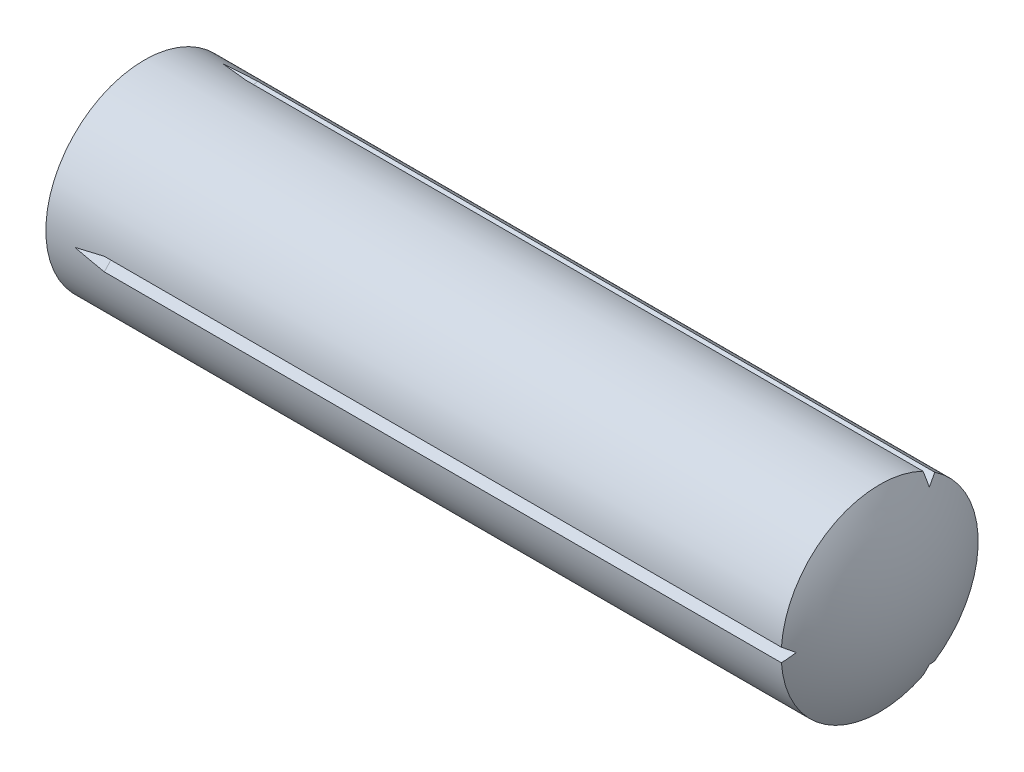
ISO-10303-21;
HEADER;
FILE_DESCRIPTION(('STEP AP214'),'2;1');
FILE_NAME('part.step','',(''),(''),'','','');
FILE_SCHEMA(('AUTOMOTIVE_DESIGN { 1 0 10303 214 1 1 1 1 }'));
ENDSEC;
DATA;
#1=APPLICATION_CONTEXT('core data for automotive mechanical design processes');
#2=APPLICATION_PROTOCOL_DEFINITION('international standard','automotive_design',2000,#1);
#3=PRODUCT_CONTEXT('',#1,'mechanical');
#4=PRODUCT('Part','Part','',(#3));
#5=PRODUCT_RELATED_PRODUCT_CATEGORY('part','',(#4));
#6=PRODUCT_DEFINITION_FORMATION('','',#4);
#7=PRODUCT_DEFINITION_CONTEXT('part definition',#1,'design');
#8=PRODUCT_DEFINITION('design','',#6,#7);
#9=PRODUCT_DEFINITION_SHAPE('','',#8);
#10=(LENGTH_UNIT() NAMED_UNIT(*) SI_UNIT(.MILLI.,.METRE.));
#11=(NAMED_UNIT(*) PLANE_ANGLE_UNIT() SI_UNIT($,.RADIAN.));
#12=(NAMED_UNIT(*) SI_UNIT($,.STERADIAN.) SOLID_ANGLE_UNIT());
#13=UNCERTAINTY_MEASURE_WITH_UNIT(LENGTH_MEASURE(1.E-05),#10,'distance_accuracy_value','');
#14=(GEOMETRIC_REPRESENTATION_CONTEXT(3) GLOBAL_UNCERTAINTY_ASSIGNED_CONTEXT((#13)) GLOBAL_UNIT_ASSIGNED_CONTEXT((#10,
#11,#12)) REPRESENTATION_CONTEXT('',''));
#15=CARTESIAN_POINT('',(0.,0.,0.));
#16=DIRECTION('',(0.,0.,1.));
#17=DIRECTION('',(1.,0.,0.));
#18=AXIS2_PLACEMENT_3D('',#15,#16,#17);
#19=CARTESIAN_POINT('',(-75.0312695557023,0.,0.));
#20=DIRECTION('',(-1.,0.,0.));
#21=DIRECTION('',(0.,1.,0.));
#22=AXIS2_PLACEMENT_3D('',#19,#20,#21);
#23=SPHERICAL_SURFACE('',#22,25.);
#24=CARTESIAN_POINT('',(-100.,0.,0.));
#25=DIRECTION('',(-1.,0.,0.));
#26=DIRECTION('',(0.,0.,1.));
#27=AXIS2_PLACEMENT_3D('',#24,#25,#26);
#28=CIRCLE('',#27,1.25);
#29=CARTESIAN_POINT('',(-100.,1.2500000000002,0.));
#30=VERTEX_POINT('',#29);
#31=EDGE_CURVE('E189',#30,#30,#28,.T.);
#32=CARTESIAN_POINT('',(-96.6819046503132,0.,0.));
#33=DIRECTION('',(-1.,0.,0.));
#34=DIRECTION('',(0.,0.,1.));
#35=AXIS2_PLACEMENT_3D('',#32,#33,#34);
#36=CIRCLE('',#35,12.5);
#37=CARTESIAN_POINT('',(-96.6819046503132,12.5,0.));
#38=VERTEX_POINT('',#37);
#39=EDGE_CURVE('E181',#38,#38,#36,.T.);
#40=CARTESIAN_POINT('',(-100.,1.2500000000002,0.));
#41=CARTESIAN_POINT('',(-99.9938336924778,1.37317333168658,0.));
#42=CARTESIAN_POINT('',(-99.9867558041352,1.49630102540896,0.));
#43=CARTESIAN_POINT('',(-99.9707787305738,1.74243819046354,0.));
#44=CARTESIAN_POINT('',(-99.9618795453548,1.86544766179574,0.));
#45=CARTESIAN_POINT('',(-99.942261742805,2.11132143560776,0.));
#46=CARTESIAN_POINT('',(-99.931543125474,2.23418573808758,0.));
#47=CARTESIAN_POINT('',(-99.9082888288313,2.47974226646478,0.));
#48=CARTESIAN_POINT('',(-99.8957531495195,2.60243449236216,0.));
#49=CARTESIAN_POINT('',(-99.8688674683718,2.84761999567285,0.));
#50=CARTESIAN_POINT('',(-99.854517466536,2.97011327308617,0.));
#51=CARTESIAN_POINT('',(-99.8240062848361,3.21487405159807,0.));
#52=CARTESIAN_POINT('',(-99.8078451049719,3.33714155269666,0.));
#53=CARTESIAN_POINT('',(-99.7737151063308,3.58142400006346,0.));
#54=CARTESIAN_POINT('',(-99.7557462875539,3.70343894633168,0.));
#55=CARTESIAN_POINT('',(-99.718004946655,3.94718956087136,0.));
#56=CARTESIAN_POINT('',(-99.698232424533,4.06892522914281,0.));
#57=CARTESIAN_POINT('',(-99.6568880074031,4.31209062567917,0.));
#58=CARTESIAN_POINT('',(-99.6353161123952,4.43352035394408,0.));
#59=CARTESIAN_POINT('',(-99.5903776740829,4.6760472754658,0.));
#60=CARTESIAN_POINT('',(-99.5670111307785,4.7971444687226,0.));
#61=CARTESIAN_POINT('',(-99.5184885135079,5.03897979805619,0.));
#62=CARTESIAN_POINT('',(-99.4933324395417,5.15971793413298,0.));
#63=CARTESIAN_POINT('',(-99.4412362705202,5.40080870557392,0.));
#64=CARTESIAN_POINT('',(-99.414296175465,5.52116134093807,0.));
#65=CARTESIAN_POINT('',(-99.3586378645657,5.76145475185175,0.));
#66=CARTESIAN_POINT('',(-99.3299196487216,5.88139552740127,0.));
#67=CARTESIAN_POINT('',(-99.2707113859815,6.12083894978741,0.));
#68=CARTESIAN_POINT('',(-99.2402213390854,6.24034159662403,0.));
#69=CARTESIAN_POINT('',(-99.1774760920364,6.47888258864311,0.));
#70=CARTESIAN_POINT('',(-99.1452208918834,6.59792093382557,0.));
#71=CARTESIAN_POINT('',(-99.078952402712,6.83550725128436,0.));
#72=CARTESIAN_POINT('',(-99.0449391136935,6.95405522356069,0.));
#73=CARTESIAN_POINT('',(-98.9751618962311,7.19063483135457,0.));
#74=CARTESIAN_POINT('',(-98.9393979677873,7.30866646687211,0.));
#75=CARTESIAN_POINT('',(-98.8661273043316,7.54418755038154,0.));
#76=CARTESIAN_POINT('',(-98.8286205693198,7.66167699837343,0.));
#77=CARTESIAN_POINT('',(-98.7518725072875,7.8960879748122,0.));
#78=CARTESIAN_POINT('',(-98.712631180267,8.01300950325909,0.));
#79=CARTESIAN_POINT('',(-98.6324225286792,8.24625903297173,0.));
#80=CARTESIAN_POINT('',(-98.5914552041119,8.36258703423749,0.));
#81=CARTESIAN_POINT('',(-98.5078035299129,8.59462403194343,0.));
#82=CARTESIAN_POINT('',(-98.4651191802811,8.71033302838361,0.));
#83=CARTESIAN_POINT('',(-98.3780428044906,8.94110667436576,0.));
#84=CARTESIAN_POINT('',(-98.3336507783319,9.05617132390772,0.));
#85=CARTESIAN_POINT('',(-98.2431687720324,9.28563107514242,0.));
#86=CARTESIAN_POINT('',(-98.1970787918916,9.40002617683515,0.));
#87=CARTESIAN_POINT('',(-98.1032109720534,9.62812177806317,0.));
#88=CARTESIAN_POINT('',(-98.055433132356,9.74182227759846,0.));
#89=CARTESIAN_POINT('',(-97.9582000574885,9.96850377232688,0.));
#90=CARTESIAN_POINT('',(-97.9087448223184,10.08148476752,0.));
#91=CARTESIAN_POINT('',(-97.8081677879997,10.3067025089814,0.));
#92=CARTESIAN_POINT('',(-97.7570459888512,10.4189392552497,0.));
#93=CARTESIAN_POINT('',(-97.6531470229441,10.6426439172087,0.));
#94=CARTESIAN_POINT('',(-97.6003698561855,10.7541118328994,0.));
#95=CARTESIAN_POINT('',(-97.4931717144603,10.9762544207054,0.));
#96=CARTESIAN_POINT('',(-97.4387507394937,11.0869290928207,0.));
#97=CARTESIAN_POINT('',(-97.3282768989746,11.307460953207,0.));
#98=CARTESIAN_POINT('',(-97.272224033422,11.417318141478,0.));
#99=CARTESIAN_POINT('',(-97.1584986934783,11.6361909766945,0.));
#100=CARTESIAN_POINT('',(-97.1008262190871,11.7452066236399,0.));
#101=CARTESIAN_POINT('',(-96.9838742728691,11.9623724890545,0.));
#102=CARTESIAN_POINT('',(-96.9245948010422,12.0705227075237,0.));
#103=CARTESIAN_POINT('',(-96.8044419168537,12.2859340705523,0.));
#104=CARTESIAN_POINT('',(-96.743568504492,12.3931952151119,0.));
#105=CARTESIAN_POINT('',(-96.6819046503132,12.5,0.));
#106=B_SPLINE_CURVE_WITH_KNOTS('',3,(#40,#41,#42,#43,#44,#45,#46,#47,#48,#49,#50,#51,#52,#53,
#54,#55,#56,#57,#58,#59,#60,#61,#62,#63,#64,#65,#66,#67,#68,#69,#70,#71,#72,#73,#74,#75,#76,#77,
#78,#79,#80,#81,#82,#83,#84,#85,#86,#87,#88,#89,#90,#91,#92,#93,#94,#95,#96,#97,#98,#99,#100,
#101,#102,#103,#104,#105),.UNSPECIFIED.,.F.,.F.,(4,2,2,2,2,2,2,2,2,2,2,2,2,2,2,2,2,2,2,2,2,2,2,
2,2,2,2,2,2,2,2,2,4),(0.,0.369979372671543,0.739958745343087,1.10993811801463,1.47991749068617,
1.84989686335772,2.21987623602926,2.5898556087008,2.95983498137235,3.32981435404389,
3.69979372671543,4.06977309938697,4.43975247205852,4.80973184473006,5.17971121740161,
5.54969059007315,5.91966996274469,6.28964933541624,6.65962870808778,7.02960808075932,
7.39958745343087,7.76956682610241,8.13954619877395,8.5095255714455,8.87950494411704,
9.24948431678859,9.61946368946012,9.98944306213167,10.3594224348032,10.7294018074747,
11.0993811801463,11.4693605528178,11.8393399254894),.UNSPECIFIED.);
#107=EDGE_CURVE('BSEAM45',#30,#38,#106,.T.);
#108=ORIENTED_EDGE('',*,*,#31,.F.);
#109=ORIENTED_EDGE('',*,*,#39,.T.);
#110=ORIENTED_EDGE('',*,*,#107,.T.);
#111=ORIENTED_EDGE('',*,*,#107,.F.);
#112=EDGE_LOOP('',(#108,#110,#109,#111));
#113=FACE_BOUND('',#112,.T.);
#114=ADVANCED_FACE('F45',(#113),#23,.T.);
#115=CARTESIAN_POINT('',(-100.,0.,0.));
#116=DIRECTION('',(1.,0.,0.));
#117=DIRECTION('',(0.,0.,-1.));
#118=AXIS2_PLACEMENT_3D('',#115,#116,#117);
#119=PLANE('',#118);
#120=ORIENTED_EDGE('',*,*,#31,.T.);
#121=EDGE_LOOP('',(#120));
#122=FACE_BOUND('',#121,.T.);
#123=ADVANCED_FACE('F247',(#122),#119,.F.);
#124=CARTESIAN_POINT('',(-25.,0.,0.));
#125=DIRECTION('',(-1.,0.,0.));
#126=DIRECTION('',(0.,1.,0.));
#127=AXIS2_PLACEMENT_3D('',#124,#125,#126);
#128=SPHERICAL_SURFACE('',#127,25.);
#129=CARTESIAN_POINT('',(-25.,5.84816389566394,2.72704361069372));
#130=DIRECTION('',(0.,-0.906307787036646,-0.422618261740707));
#131=DIRECTION('',(0.,0.422618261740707,-0.906307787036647));
#132=AXIS2_PLACEMENT_3D('',#129,#130,#131);
#133=CIRCLE('',#132,24.1528924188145);
#134=CARTESIAN_POINT('',(-3.34936490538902,10.372592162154,-6.97562411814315));
#135=VERTEX_POINT('',#134);
#136=CARTESIAN_POINT('',(-2.67428612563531,9.74278579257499,-5.62499999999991));
#137=VERTEX_POINT('',#136);
#138=EDGE_CURVE('E57',#135,#137,#133,.T.);
#139=ORIENTED_EDGE('',*,*,#138,.T.);
#140=CARTESIAN_POINT('',(-25.,0.562392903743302,-6.42818030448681));
#141=DIRECTION('',(0.,-0.0871557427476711,0.996194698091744));
#142=DIRECTION('',(0.,-0.996194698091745,-0.0871557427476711));
#143=AXIS2_PLACEMENT_3D('',#140,#141,#142);
#144=CIRCLE('',#143,24.1528924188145);
#145=CARTESIAN_POINT('',(-3.34936490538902,11.2273637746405,-5.49511625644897));
#146=VERTEX_POINT('',#145);
#147=EDGE_CURVE('E143',#137,#146,#144,.T.);
#148=ORIENTED_EDGE('',*,*,#147,.T.);
#149=CARTESIAN_POINT('',(-3.34936490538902,0.,0.));
#150=DIRECTION('',(-1.,0.,0.));
#151=DIRECTION('',(0.,0.,1.));
#152=AXIS2_PLACEMENT_3D('',#149,#150,#151);
#153=CIRCLE('',#152,12.5);
#154=CARTESIAN_POINT('',(-3.34936490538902,0.854771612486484,12.4707403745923));
#155=VERTEX_POINT('',#154);
#156=EDGE_CURVE('E184',#155,#146,#153,.T.);
#157=ORIENTED_EDGE('',*,*,#156,.F.);
#158=CARTESIAN_POINT('',(-25.,-5.28577099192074,3.70113669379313));
#159=DIRECTION('',(0.,0.819152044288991,-0.573576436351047));
#160=DIRECTION('',(0.,0.573576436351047,0.819152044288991));
#161=AXIS2_PLACEMENT_3D('',#158,#159,#160);
#162=CIRCLE('',#161,24.1528924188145);
#163=CARTESIAN_POINT('',(-2.67428612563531,0.,11.25));
#164=VERTEX_POINT('',#163);
#165=EDGE_CURVE('E174',#155,#164,#162,.T.);
#166=ORIENTED_EDGE('',*,*,#165,.T.);
#167=CARTESIAN_POINT('',(-25.,5.28577099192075,3.70113669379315));
#168=DIRECTION('',(0.,-0.81915204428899,-0.573576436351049));
#169=DIRECTION('',(0.,0.573576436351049,-0.81915204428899));
#170=AXIS2_PLACEMENT_3D('',#167,#168,#169);
#171=CIRCLE('',#170,24.1528924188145);
#172=CARTESIAN_POINT('',(-3.34936490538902,-0.854771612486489,12.4707403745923));
#173=VERTEX_POINT('',#172);
#174=EDGE_CURVE('E178',#164,#173,#171,.T.);
#175=ORIENTED_EDGE('',*,*,#174,.T.);
#176=CARTESIAN_POINT('',(-3.34936490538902,-11.2273637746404,-5.49511625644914));
#177=VERTEX_POINT('',#176);
#178=EDGE_CURVE('E183',#177,#173,#153,.T.);
#179=ORIENTED_EDGE('',*,*,#178,.F.);
#180=CARTESIAN_POINT('',(-25.,-0.562392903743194,-6.4281803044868));
#181=DIRECTION('',(0.,0.0871557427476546,0.996194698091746));
#182=DIRECTION('',(0.,-0.996194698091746,0.0871557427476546));
#183=AXIS2_PLACEMENT_3D('',#180,#181,#182);
#184=CIRCLE('',#183,24.1528924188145);
#185=CARTESIAN_POINT('',(-2.67428612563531,-9.74278579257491,-5.62500000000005));
#186=VERTEX_POINT('',#185);
#187=EDGE_CURVE('E63',#177,#186,#184,.T.);
#188=ORIENTED_EDGE('',*,*,#187,.T.);
#189=CARTESIAN_POINT('',(-25.,-5.84816389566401,2.72704361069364));
#190=DIRECTION('',(0.,0.906307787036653,-0.422618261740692));
#191=DIRECTION('',(0.,0.422618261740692,0.906307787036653));
#192=AXIS2_PLACEMENT_3D('',#189,#190,#191);
#193=CIRCLE('',#192,24.1528924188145);
#194=CARTESIAN_POINT('',(-3.34936490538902,-10.3725921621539,-6.9756241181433));
#195=VERTEX_POINT('',#194);
#196=EDGE_CURVE('E163',#186,#195,#193,.T.);
#197=ORIENTED_EDGE('',*,*,#196,.T.);
#198=EDGE_CURVE('E186',#135,#195,#153,.T.);
#199=ORIENTED_EDGE('',*,*,#198,.F.);
#200=EDGE_LOOP('',(#139,#148,#157,#166,#175,#179,#188,#197,#199));
#201=FACE_BOUND('',#200,.T.);
#202=ADVANCED_FACE('F220',(#201),#128,.T.);
#203=CARTESIAN_POINT('',(-117.,0.,0.));
#204=DIRECTION('',(-1.,0.,0.));
#205=DIRECTION('',(0.,0.,1.));
#206=AXIS2_PLACEMENT_3D('',#203,#204,#205);
#207=CYLINDRICAL_SURFACE('',#206,12.5);
#208=ORIENTED_EDGE('',*,*,#39,.F.);
#209=EDGE_LOOP('',(#208));
#210=FACE_BOUND('',#209,.T.);
#211=ORIENTED_EDGE('',*,*,#156,.T.);
#212=DIRECTION('',(-1.,0.,0.));
#213=VECTOR('',#212,1.);
#214=CARTESIAN_POINT('',(-117.,11.2273637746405,-5.49511625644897));
#215=LINE('',#214,#213);
#216=CARTESIAN_POINT('',(-89.2885509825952,11.2273637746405,-5.49511625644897));
#217=VERTEX_POINT('',#216);
#218=EDGE_CURVE('E12',#146,#217,#215,.T.);
#219=ORIENTED_EDGE('',*,*,#218,.T.);
#220=CARTESIAN_POINT('',(-58.0000000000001,0.,0.));
#221=DIRECTION('',(0.192914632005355,0.058217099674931,-0.979486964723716));
#222=DIRECTION('',(-0.981215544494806,0.0114459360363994,-0.192574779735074));
#223=AXIS2_PLACEMENT_3D('',#220,#221,#222);
#224=ELLIPSE('',#223,64.7954998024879,12.5);
#225=CARTESIAN_POINT('',(-93.,10.8253175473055,-6.2499999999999));
#226=VERTEX_POINT('',#225);
#227=EDGE_CURVE('E47',#226,#217,#224,.T.);
#228=ORIENTED_EDGE('',*,*,#227,.F.);
#229=CARTESIAN_POINT('',(-58.0000000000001,0.,0.));
#230=DIRECTION('',(0.192914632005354,0.877369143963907,0.439325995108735));
#231=DIRECTION('',(-0.981215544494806,0.172497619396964,0.0863749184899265));
#232=AXIS2_PLACEMENT_3D('',#229,#230,#231);
#233=ELLIPSE('',#232,64.7954998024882,12.5);
#234=CARTESIAN_POINT('',(-89.2885509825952,10.372592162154,-6.97562411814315));
#235=VERTEX_POINT('',#234);
#236=EDGE_CURVE('E138',#235,#226,#233,.T.);
#237=ORIENTED_EDGE('',*,*,#236,.F.);
#238=DIRECTION('',(-1.,0.,0.));
#239=VECTOR('',#238,1.);
#240=CARTESIAN_POINT('',(-117.,10.372592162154,-6.97562411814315));
#241=LINE('',#240,#239);
#242=EDGE_CURVE('E142',#235,#135,#241,.F.);
#243=ORIENTED_EDGE('',*,*,#242,.T.);
#244=ORIENTED_EDGE('',*,*,#198,.T.);
#245=DIRECTION('',(-1.,0.,0.));
#246=VECTOR('',#245,1.);
#247=CARTESIAN_POINT('',(-117.,-10.3725921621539,-6.9756241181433));
#248=LINE('',#247,#246);
#249=CARTESIAN_POINT('',(-89.2885509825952,-10.3725921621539,-6.9756241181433));
#250=VERTEX_POINT('',#249);
#251=EDGE_CURVE('E206',#195,#250,#248,.T.);
#252=ORIENTED_EDGE('',*,*,#251,.T.);
#253=CARTESIAN_POINT('',(-58.0000000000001,0.,0.));
#254=DIRECTION('',(0.192914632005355,-0.877369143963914,0.439325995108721));
#255=DIRECTION('',(-0.981215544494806,-0.172497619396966,0.0863749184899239));
#256=AXIS2_PLACEMENT_3D('',#253,#254,#255);
#257=ELLIPSE('',#256,64.7954998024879,12.5);
#258=CARTESIAN_POINT('',(-93.,-10.8253175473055,-6.25000000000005));
#259=VERTEX_POINT('',#258);
#260=EDGE_CURVE('E207',#259,#250,#257,.T.);
#261=ORIENTED_EDGE('',*,*,#260,.F.);
#262=CARTESIAN_POINT('',(-58.0000000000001,0.,0.));
#263=DIRECTION('',(0.192914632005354,-0.0582170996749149,-0.979486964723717));
#264=DIRECTION('',(-0.981215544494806,-0.0114459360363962,-0.192574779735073));
#265=AXIS2_PLACEMENT_3D('',#262,#263,#264);
#266=ELLIPSE('',#265,64.7954998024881,12.5);
#267=CARTESIAN_POINT('',(-89.2885509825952,-11.2273637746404,-5.49511625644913));
#268=VERTEX_POINT('',#267);
#269=EDGE_CURVE('E204',#268,#259,#266,.T.);
#270=ORIENTED_EDGE('',*,*,#269,.F.);
#271=DIRECTION('',(-1.,0.,0.));
#272=VECTOR('',#271,1.);
#273=CARTESIAN_POINT('',(-117.,-11.2273637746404,-5.49511625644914));
#274=LINE('',#273,#272);
#275=EDGE_CURVE('E205',#268,#177,#274,.F.);
#276=ORIENTED_EDGE('',*,*,#275,.T.);
#277=ORIENTED_EDGE('',*,*,#178,.T.);
#278=DIRECTION('',(-1.,0.,0.));
#279=VECTOR('',#278,1.);
#280=CARTESIAN_POINT('',(-117.,-0.854771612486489,12.4707403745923));
#281=LINE('',#280,#279);
#282=CARTESIAN_POINT('',(-89.2885509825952,-0.854771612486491,12.4707403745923));
#283=VERTEX_POINT('',#282);
#284=EDGE_CURVE('E197',#173,#283,#281,.T.);
#285=ORIENTED_EDGE('',*,*,#284,.T.);
#286=CARTESIAN_POINT('',(-58.0000000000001,0.,0.));
#287=DIRECTION('',(0.192914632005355,0.81915204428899,0.540160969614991));
#288=DIRECTION('',(-0.981215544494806,0.161051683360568,0.106199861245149));
#289=AXIS2_PLACEMENT_3D('',#286,#287,#288);
#290=ELLIPSE('',#289,64.7954998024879,12.5);
#291=CARTESIAN_POINT('',(-93.,0.,12.5));
#292=VERTEX_POINT('',#291);
#293=EDGE_CURVE('E200',#292,#283,#290,.T.);
#294=ORIENTED_EDGE('',*,*,#293,.F.);
#295=CARTESIAN_POINT('',(-58.0000000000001,0.,0.));
#296=DIRECTION('',(0.192914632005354,-0.819152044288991,0.540160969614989));
#297=DIRECTION('',(-0.981215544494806,-0.161051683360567,0.106199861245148));
#298=AXIS2_PLACEMENT_3D('',#295,#296,#297);
#299=ELLIPSE('',#298,64.7954998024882,12.5);
#300=CARTESIAN_POINT('',(-89.2885509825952,0.854771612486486,12.4707403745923));
#301=VERTEX_POINT('',#300);
#302=EDGE_CURVE('E195',#301,#292,#299,.T.);
#303=ORIENTED_EDGE('',*,*,#302,.F.);
#304=DIRECTION('',(-1.,0.,0.));
#305=VECTOR('',#304,1.);
#306=CARTESIAN_POINT('',(-117.,0.854771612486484,12.4707403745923));
#307=LINE('',#306,#305);
#308=EDGE_CURVE('E192',#301,#155,#307,.F.);
#309=ORIENTED_EDGE('',*,*,#308,.T.);
#310=EDGE_LOOP('',(#211,#219,#228,#237,#243,#244,#252,#261,#270,#276,#277,#285,#294,#303,#309));
#311=FACE_BOUND('',#310,.T.);
#312=ADVANCED_FACE('F213',(#210,#311),#207,.T.);
#313=CARTESIAN_POINT('',(-89.5403135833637,0.16296555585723,11.0172610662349));
#314=DIRECTION('',(0.192914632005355,0.81915204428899,0.540160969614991));
#315=DIRECTION('',(0.,-0.550501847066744,0.834833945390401));
#316=AXIS2_PLACEMENT_3D('',#313,#314,#315);
#317=PLANE('',#316);
#318=ORIENTED_EDGE('',*,*,#293,.T.);
#319=DIRECTION('',(-0.140481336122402,0.567888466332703,-0.81102878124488));
#320=VECTOR('',#319,1.);
#321=CARTESIAN_POINT('',(-89.5403135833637,0.16296555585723,11.0172610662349));
#322=LINE('',#321,#320);
#323=CARTESIAN_POINT('',(-89.5,0.,11.25));
#324=VERTEX_POINT('',#323);
#325=EDGE_CURVE('E169',#283,#324,#322,.T.);
#326=ORIENTED_EDGE('',*,*,#325,.T.);
#327=DIRECTION('',(-0.941741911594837,0.,0.336336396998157));
#328=VECTOR('',#327,1.);
#329=CARTESIAN_POINT('',(-89.5,0.,11.25));
#330=LINE('',#329,#328);
#331=EDGE_CURVE('E166',#324,#292,#330,.T.);
#332=ORIENTED_EDGE('',*,*,#331,.T.);
#333=EDGE_LOOP('',(#318,#326,#332));
#334=FACE_BOUND('',#333,.T.);
#335=ADVANCED_FACE('F232',(#334),#317,.T.);
#336=CARTESIAN_POINT('',(-89.5403135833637,-0.162965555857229,11.0172610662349));
#337=DIRECTION('',(0.192914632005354,-0.819152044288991,0.540160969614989));
#338=DIRECTION('',(0.,-0.550501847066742,-0.834833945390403));
#339=AXIS2_PLACEMENT_3D('',#336,#337,#338);
#340=PLANE('',#339);
#341=ORIENTED_EDGE('',*,*,#302,.T.);
#342=ORIENTED_EDGE('',*,*,#331,.F.);
#343=DIRECTION('',(0.140481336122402,0.567888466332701,0.811028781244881));
#344=VECTOR('',#343,1.);
#345=CARTESIAN_POINT('',(-89.5403135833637,-0.162965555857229,11.0172610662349));
#346=LINE('',#345,#344);
#347=EDGE_CURVE('E164',#324,#301,#346,.T.);
#348=ORIENTED_EDGE('',*,*,#347,.T.);
#349=EDGE_LOOP('',(#341,#342,#348));
#350=FACE_BOUND('',#349,.T.);
#351=ADVANCED_FACE('F231',(#350),#340,.T.);
#352=CARTESIAN_POINT('',(-91.5427449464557,0.,11.25));
#353=DIRECTION('',(0.,-0.81915204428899,-0.573576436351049));
#354=DIRECTION('',(0.,0.573576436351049,-0.81915204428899));
#355=AXIS2_PLACEMENT_3D('',#352,#353,#354);
#356=PLANE('',#355);
#357=DIRECTION('',(1.,0.,0.));
#358=VECTOR('',#357,1.);
#359=CARTESIAN_POINT('',(-91.5427449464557,0.,11.25));
#360=LINE('',#359,#358);
#361=EDGE_CURVE('E165',#324,#164,#360,.T.);
#362=ORIENTED_EDGE('',*,*,#361,.F.);
#363=ORIENTED_EDGE('',*,*,#325,.F.);
#364=ORIENTED_EDGE('',*,*,#284,.F.);
#365=ORIENTED_EDGE('',*,*,#174,.F.);
#366=EDGE_LOOP('',(#362,#363,#364,#365));
#367=FACE_BOUND('',#366,.T.);
#368=ADVANCED_FACE('F221',(#367),#356,.F.);
#369=CARTESIAN_POINT('',(-91.5427449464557,0.,11.25));
#370=DIRECTION('',(0.,0.819152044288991,-0.573576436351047));
#371=DIRECTION('',(0.,0.573576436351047,0.819152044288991));
#372=AXIS2_PLACEMENT_3D('',#369,#370,#371);
#373=PLANE('',#372);
#374=ORIENTED_EDGE('',*,*,#308,.F.);
#375=ORIENTED_EDGE('',*,*,#347,.F.);
#376=ORIENTED_EDGE('',*,*,#361,.T.);
#377=ORIENTED_EDGE('',*,*,#165,.F.);
#378=EDGE_LOOP('',(#374,#375,#376,#377));
#379=FACE_BOUND('',#378,.T.);
#380=ADVANCED_FACE('F226',(#379),#373,.F.);
#381=CARTESIAN_POINT('',(-89.5390504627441,-9.62647297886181,-5.37556636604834));
#382=DIRECTION('',(0.192914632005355,-0.877369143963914,0.439325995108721));
#383=DIRECTION('',(0.,-0.447736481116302,-0.894165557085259));
#384=AXIS2_PLACEMENT_3D('',#381,#382,#383);
#385=PLANE('',#384);
#386=ORIENTED_EDGE('',*,*,#260,.T.);
#387=DIRECTION('',(-0.140481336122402,0.418427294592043,0.897320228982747));
#388=VECTOR('',#387,1.);
#389=CARTESIAN_POINT('',(-89.5390504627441,-9.62647297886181,-5.37556636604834));
#390=LINE('',#389,#388);
#391=CARTESIAN_POINT('',(-89.5,-9.74278579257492,-5.62500000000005));
#392=VERTEX_POINT('',#391);
#393=EDGE_CURVE('E154',#250,#392,#390,.T.);
#394=ORIENTED_EDGE('',*,*,#393,.T.);
#395=DIRECTION('',(-0.941741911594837,-0.291275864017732,-0.16816819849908));
#396=VECTOR('',#395,1.);
#397=CARTESIAN_POINT('',(-89.5,-9.74278579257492,-5.62500000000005));
#398=LINE('',#397,#396);
#399=EDGE_CURVE('E152',#392,#259,#398,.T.);
#400=ORIENTED_EDGE('',*,*,#399,.T.);
#401=EDGE_LOOP('',(#386,#394,#400));
#402=FACE_BOUND('',#401,.T.);
#403=ADVANCED_FACE('F273',(#402),#385,.T.);
#404=CARTESIAN_POINT('',(-89.5390504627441,-9.46861352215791,-5.6489869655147));
#405=DIRECTION('',(0.192914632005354,-0.0582170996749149,-0.979486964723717));
#406=DIRECTION('',(-0.981151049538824,0.,-0.193242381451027));
#407=AXIS2_PLACEMENT_3D('',#404,#405,#406);
#408=PLANE('',#407);
#409=ORIENTED_EDGE('',*,*,#269,.T.);
#410=ORIENTED_EDGE('',*,*,#399,.F.);
#411=DIRECTION('',(0.140481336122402,-0.98631576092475,0.0862914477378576));
#412=VECTOR('',#411,1.);
#413=CARTESIAN_POINT('',(-89.5390504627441,-9.46861352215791,-5.6489869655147));
#414=LINE('',#413,#412);
#415=EDGE_CURVE('E153',#392,#268,#414,.T.);
#416=ORIENTED_EDGE('',*,*,#415,.T.);
#417=EDGE_LOOP('',(#409,#410,#416));
#418=FACE_BOUND('',#417,.T.);
#419=ADVANCED_FACE('F278',(#418),#408,.T.);
#420=CARTESIAN_POINT('',(-91.4787408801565,-9.74278579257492,-5.62500000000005));
#421=DIRECTION('',(0.,0.906307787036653,-0.422618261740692));
#422=DIRECTION('',(0.,0.422618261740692,0.906307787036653));
#423=AXIS2_PLACEMENT_3D('',#420,#421,#422);
#424=PLANE('',#423);
#425=DIRECTION('',(1.,0.,0.));
#426=VECTOR('',#425,1.);
#427=CARTESIAN_POINT('',(-91.4787408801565,-9.74278579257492,-5.62500000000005));
#428=LINE('',#427,#426);
#429=EDGE_CURVE('E150',#392,#186,#428,.T.);
#430=ORIENTED_EDGE('',*,*,#429,.F.);
#431=ORIENTED_EDGE('',*,*,#393,.F.);
#432=ORIENTED_EDGE('',*,*,#251,.F.);
#433=ORIENTED_EDGE('',*,*,#196,.F.);
#434=EDGE_LOOP('',(#430,#431,#432,#433));
#435=FACE_BOUND('',#434,.T.);
#436=ADVANCED_FACE('F288',(#435),#424,.F.);
#437=CARTESIAN_POINT('',(-91.4787408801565,-9.74278579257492,-5.62500000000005));
#438=DIRECTION('',(0.,0.0871557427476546,0.996194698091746));
#439=DIRECTION('',(0.,-0.996194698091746,0.0871557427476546));
#440=AXIS2_PLACEMENT_3D('',#437,#438,#439);
#441=PLANE('',#440);
#442=ORIENTED_EDGE('',*,*,#275,.F.);
#443=ORIENTED_EDGE('',*,*,#415,.F.);
#444=ORIENTED_EDGE('',*,*,#429,.T.);
#445=ORIENTED_EDGE('',*,*,#187,.F.);
#446=EDGE_LOOP('',(#442,#443,#444,#445));
#447=FACE_BOUND('',#446,.T.);
#448=ADVANCED_FACE('F300',(#447),#441,.F.);
#449=CARTESIAN_POINT('',(-89.5390504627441,9.46861352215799,-5.64898696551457));
#450=DIRECTION('',(0.192914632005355,0.058217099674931,-0.979486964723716));
#451=DIRECTION('',(-0.981151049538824,0.,-0.193242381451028));
#452=AXIS2_PLACEMENT_3D('',#449,#450,#451);
#453=PLANE('',#452);
#454=ORIENTED_EDGE('',*,*,#227,.T.);
#455=DIRECTION('',(-0.140481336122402,-0.986315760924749,-0.0862914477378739));
#456=VECTOR('',#455,1.);
#457=CARTESIAN_POINT('',(-89.5390504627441,9.46861352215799,-5.64898696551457));
#458=LINE('',#457,#456);
#459=CARTESIAN_POINT('',(-89.5,9.742785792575,-5.62499999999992));
#460=VERTEX_POINT('',#459);
#461=EDGE_CURVE('E124',#217,#460,#458,.T.);
#462=ORIENTED_EDGE('',*,*,#461,.T.);
#463=DIRECTION('',(-0.941741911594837,0.291275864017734,-0.168168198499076));
#464=VECTOR('',#463,1.);
#465=CARTESIAN_POINT('',(-89.5,9.742785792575,-5.62499999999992));
#466=LINE('',#465,#464);
#467=EDGE_CURVE('E126',#460,#226,#466,.T.);
#468=ORIENTED_EDGE('',*,*,#467,.T.);
#469=EDGE_LOOP('',(#454,#462,#468));
#470=FACE_BOUND('',#469,.T.);
#471=ADVANCED_FACE('F123',(#470),#453,.T.);
#472=CARTESIAN_POINT('',(-89.5390504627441,9.62647297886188,-5.37556636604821));
#473=DIRECTION('',(0.192914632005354,0.877369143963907,0.439325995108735));
#474=DIRECTION('',(0.,-0.447736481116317,0.894165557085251));
#475=AXIS2_PLACEMENT_3D('',#472,#473,#474);
#476=PLANE('',#475);
#477=ORIENTED_EDGE('',*,*,#236,.T.);
#478=ORIENTED_EDGE('',*,*,#467,.F.);
#479=DIRECTION('',(0.140481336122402,0.418427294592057,-0.89732022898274));
#480=VECTOR('',#479,1.);
#481=CARTESIAN_POINT('',(-89.5390504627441,9.62647297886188,-5.37556636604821));
#482=LINE('',#481,#480);
#483=EDGE_CURVE('E130',#460,#235,#482,.T.);
#484=ORIENTED_EDGE('',*,*,#483,.T.);
#485=EDGE_LOOP('',(#477,#478,#484));
#486=FACE_BOUND('',#485,.T.);
#487=ADVANCED_FACE('F137',(#486),#476,.T.);
#488=CARTESIAN_POINT('',(-91.4787408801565,9.742785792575,-5.62499999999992));
#489=DIRECTION('',(0.,-0.0871557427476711,0.996194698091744));
#490=DIRECTION('',(0.,-0.996194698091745,-0.0871557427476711));
#491=AXIS2_PLACEMENT_3D('',#488,#489,#490);
#492=PLANE('',#491);
#493=DIRECTION('',(1.,0.,0.));
#494=VECTOR('',#493,1.);
#495=CARTESIAN_POINT('',(-91.4787408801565,9.742785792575,-5.62499999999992));
#496=LINE('',#495,#494);
#497=EDGE_CURVE('E133',#460,#137,#496,.T.);
#498=ORIENTED_EDGE('',*,*,#497,.F.);
#499=ORIENTED_EDGE('',*,*,#461,.F.);
#500=ORIENTED_EDGE('',*,*,#218,.F.);
#501=ORIENTED_EDGE('',*,*,#147,.F.);
#502=EDGE_LOOP('',(#498,#499,#500,#501));
#503=FACE_BOUND('',#502,.T.);
#504=ADVANCED_FACE('F141',(#503),#492,.F.);
#505=CARTESIAN_POINT('',(-91.4787408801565,9.742785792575,-5.62499999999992));
#506=DIRECTION('',(0.,-0.906307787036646,-0.422618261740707));
#507=DIRECTION('',(0.,0.422618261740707,-0.906307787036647));
#508=AXIS2_PLACEMENT_3D('',#505,#506,#507);
#509=PLANE('',#508);
#510=ORIENTED_EDGE('',*,*,#242,.F.);
#511=ORIENTED_EDGE('',*,*,#483,.F.);
#512=ORIENTED_EDGE('',*,*,#497,.T.);
#513=ORIENTED_EDGE('',*,*,#138,.F.);
#514=EDGE_LOOP('',(#510,#511,#512,#513));
#515=FACE_BOUND('',#514,.T.);
#516=ADVANCED_FACE('F136',(#515),#509,.F.);
#517=CLOSED_SHELL('',(#114,#123,#202,#312,#335,#351,#368,#380,#403,#419,#436,#448,#471,#487,
#504,#516));
#518=MANIFOLD_SOLID_BREP('B2',#517);
#519=ADVANCED_BREP_SHAPE_REPRESENTATION('',(#18,#518),#14);
#520=SHAPE_DEFINITION_REPRESENTATION(#9,#519);
ENDSEC;
END-ISO-10303-21;
